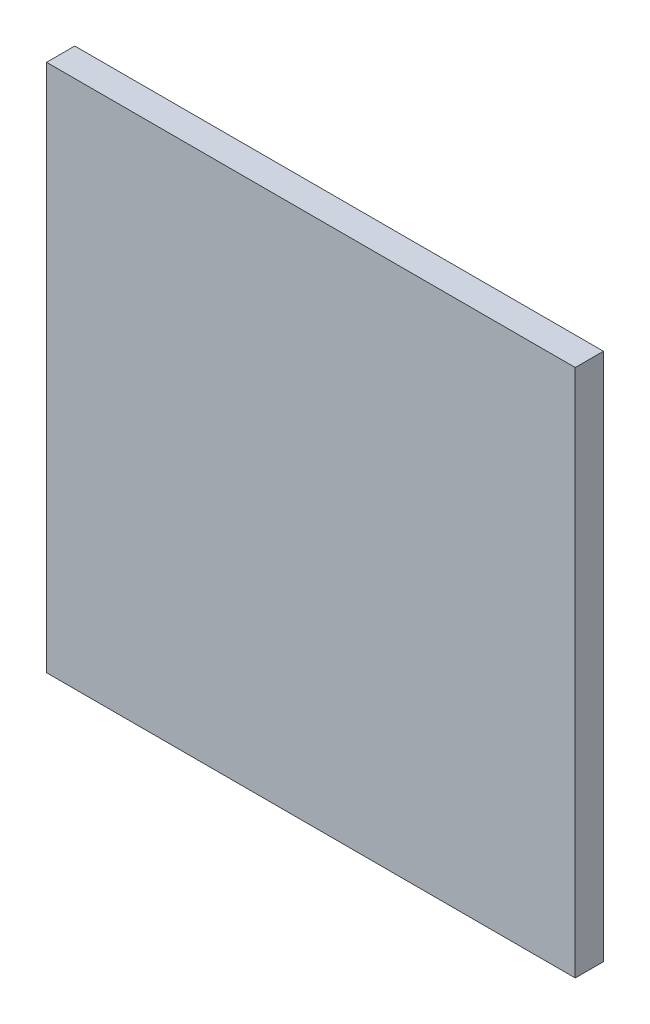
ISO-10303-21;
HEADER;
FILE_DESCRIPTION(('STEP AP214'),'2;1');
FILE_NAME('part.step','',(''),(''),'','','');
FILE_SCHEMA(('AUTOMOTIVE_DESIGN { 1 0 10303 214 1 1 1 1 }'));
ENDSEC;
DATA;
#1=APPLICATION_CONTEXT('core data for automotive mechanical design processes');
#2=APPLICATION_PROTOCOL_DEFINITION('international standard','automotive_design',2000,#1);
#3=PRODUCT_CONTEXT('',#1,'mechanical');
#4=PRODUCT('Part','Part','',(#3));
#5=PRODUCT_RELATED_PRODUCT_CATEGORY('part','',(#4));
#6=PRODUCT_DEFINITION_FORMATION('','',#4);
#7=PRODUCT_DEFINITION_CONTEXT('part definition',#1,'design');
#8=PRODUCT_DEFINITION('design','',#6,#7);
#9=PRODUCT_DEFINITION_SHAPE('','',#8);
#10=(LENGTH_UNIT() NAMED_UNIT(*) SI_UNIT(.MILLI.,.METRE.));
#11=(NAMED_UNIT(*) PLANE_ANGLE_UNIT() SI_UNIT($,.RADIAN.));
#12=(NAMED_UNIT(*) SI_UNIT($,.STERADIAN.) SOLID_ANGLE_UNIT());
#13=UNCERTAINTY_MEASURE_WITH_UNIT(LENGTH_MEASURE(1.E-05),#10,'distance_accuracy_value','');
#14=(GEOMETRIC_REPRESENTATION_CONTEXT(3) GLOBAL_UNCERTAINTY_ASSIGNED_CONTEXT((#13)) GLOBAL_UNIT_ASSIGNED_CONTEXT((#10,
#11,#12)) REPRESENTATION_CONTEXT('',''));
#15=CARTESIAN_POINT('',(0.,0.,0.));
#16=DIRECTION('',(0.,0.,1.));
#17=DIRECTION('',(1.,0.,0.));
#18=AXIS2_PLACEMENT_3D('',#15,#16,#17);
#19=CARTESIAN_POINT('',(-75.,75.,8.));
#20=DIRECTION('',(1.,0.,0.));
#21=DIRECTION('',(0.,1.,0.));
#22=AXIS2_PLACEMENT_3D('',#19,#20,#21);
#23=PLANE('',#22);
#24=DIRECTION('',(0.,-1.,0.));
#25=VECTOR('',#24,1.);
#26=CARTESIAN_POINT('',(-75.,75.,0.));
#27=LINE('',#26,#25);
#28=CARTESIAN_POINT('',(-75.,75.,0.));
#29=VERTEX_POINT('',#28);
#30=CARTESIAN_POINT('',(-75.,-75.,0.));
#31=VERTEX_POINT('',#30);
#32=EDGE_CURVE('E102',#29,#31,#27,.T.);
#33=ORIENTED_EDGE('',*,*,#32,.T.);
#34=DIRECTION('',(0.,0.,-1.));
#35=VECTOR('',#34,1.);
#36=CARTESIAN_POINT('',(-75.,-75.,8.));
#37=LINE('',#36,#35);
#38=CARTESIAN_POINT('',(-75.,-75.,8.));
#39=VERTEX_POINT('',#38);
#40=EDGE_CURVE('E11',#39,#31,#37,.T.);
#41=ORIENTED_EDGE('',*,*,#40,.F.);
#42=DIRECTION('',(0.,-1.,0.));
#43=VECTOR('',#42,1.);
#44=CARTESIAN_POINT('',(-75.,75.,8.));
#45=LINE('',#44,#43);
#46=CARTESIAN_POINT('',(-75.,75.,8.));
#47=VERTEX_POINT('',#46);
#48=EDGE_CURVE('E90',#47,#39,#45,.T.);
#49=ORIENTED_EDGE('',*,*,#48,.F.);
#50=DIRECTION('',(0.,0.,-1.));
#51=VECTOR('',#50,1.);
#52=CARTESIAN_POINT('',(-75.,75.,8.));
#53=LINE('',#52,#51);
#54=EDGE_CURVE('E98',#47,#29,#53,.T.);
#55=ORIENTED_EDGE('',*,*,#54,.T.);
#56=EDGE_LOOP('',(#33,#41,#49,#55));
#57=FACE_BOUND('',#56,.T.);
#58=ADVANCED_FACE('F39',(#57),#23,.F.);
#59=CARTESIAN_POINT('',(-75.,-75.,8.));
#60=DIRECTION('',(0.,1.,0.));
#61=DIRECTION('',(-1.,0.,0.));
#62=AXIS2_PLACEMENT_3D('',#59,#60,#61);
#63=PLANE('',#62);
#64=DIRECTION('',(1.,0.,0.));
#65=VECTOR('',#64,1.);
#66=CARTESIAN_POINT('',(-75.,-75.,0.));
#67=LINE('',#66,#65);
#68=CARTESIAN_POINT('',(75.,-75.,0.));
#69=VERTEX_POINT('',#68);
#70=EDGE_CURVE('E94',#31,#69,#67,.T.);
#71=ORIENTED_EDGE('',*,*,#70,.T.);
#72=DIRECTION('',(0.,0.,-1.));
#73=VECTOR('',#72,1.);
#74=CARTESIAN_POINT('',(75.,-75.,8.));
#75=LINE('',#74,#73);
#76=CARTESIAN_POINT('',(75.,-75.,8.));
#77=VERTEX_POINT('',#76);
#78=EDGE_CURVE('E47',#77,#69,#75,.T.);
#79=ORIENTED_EDGE('',*,*,#78,.F.);
#80=DIRECTION('',(1.,0.,0.));
#81=VECTOR('',#80,1.);
#82=CARTESIAN_POINT('',(-75.,-75.,8.));
#83=LINE('',#82,#81);
#84=EDGE_CURVE('E85',#39,#77,#83,.T.);
#85=ORIENTED_EDGE('',*,*,#84,.F.);
#86=ORIENTED_EDGE('',*,*,#40,.T.);
#87=EDGE_LOOP('',(#71,#79,#85,#86));
#88=FACE_BOUND('',#87,.T.);
#89=ADVANCED_FACE('F93',(#88),#63,.F.);
#90=CARTESIAN_POINT('',(75.,75.,8.));
#91=DIRECTION('',(-1.,0.,0.));
#92=DIRECTION('',(0.,0.,1.));
#93=AXIS2_PLACEMENT_3D('',#90,#91,#92);
#94=PLANE('',#93);
#95=DIRECTION('',(0.,1.,0.));
#96=VECTOR('',#95,1.);
#97=CARTESIAN_POINT('',(75.,75.,0.));
#98=LINE('',#97,#96);
#99=CARTESIAN_POINT('',(75.,75.,0.));
#100=VERTEX_POINT('',#99);
#101=EDGE_CURVE('E72',#69,#100,#98,.T.);
#102=ORIENTED_EDGE('',*,*,#101,.T.);
#103=DIRECTION('',(0.,0.,-1.));
#104=VECTOR('',#103,1.);
#105=CARTESIAN_POINT('',(75.,75.,8.));
#106=LINE('',#105,#104);
#107=CARTESIAN_POINT('',(75.,75.,8.));
#108=VERTEX_POINT('',#107);
#109=EDGE_CURVE('E95',#108,#100,#106,.T.);
#110=ORIENTED_EDGE('',*,*,#109,.F.);
#111=DIRECTION('',(0.,1.,0.));
#112=VECTOR('',#111,1.);
#113=CARTESIAN_POINT('',(75.,75.,8.));
#114=LINE('',#113,#112);
#115=EDGE_CURVE('E88',#77,#108,#114,.T.);
#116=ORIENTED_EDGE('',*,*,#115,.F.);
#117=ORIENTED_EDGE('',*,*,#78,.T.);
#118=EDGE_LOOP('',(#102,#110,#116,#117));
#119=FACE_BOUND('',#118,.T.);
#120=ADVANCED_FACE('F96',(#119),#94,.F.);
#121=CARTESIAN_POINT('',(-75.,75.,8.));
#122=DIRECTION('',(0.,-1.,0.));
#123=DIRECTION('',(0.,0.,-1.));
#124=AXIS2_PLACEMENT_3D('',#121,#122,#123);
#125=PLANE('',#124);
#126=DIRECTION('',(-1.,0.,0.));
#127=VECTOR('',#126,1.);
#128=CARTESIAN_POINT('',(-75.,75.,0.));
#129=LINE('',#128,#127);
#130=EDGE_CURVE('E78',#100,#29,#129,.T.);
#131=ORIENTED_EDGE('',*,*,#130,.T.);
#132=ORIENTED_EDGE('',*,*,#54,.F.);
#133=DIRECTION('',(-1.,0.,0.));
#134=VECTOR('',#133,1.);
#135=CARTESIAN_POINT('',(-75.,75.,8.));
#136=LINE('',#135,#134);
#137=EDGE_CURVE('E55',#108,#47,#136,.T.);
#138=ORIENTED_EDGE('',*,*,#137,.F.);
#139=ORIENTED_EDGE('',*,*,#109,.T.);
#140=EDGE_LOOP('',(#131,#132,#138,#139));
#141=FACE_BOUND('',#140,.T.);
#142=ADVANCED_FACE('F109',(#141),#125,.F.);
#143=CARTESIAN_POINT('',(-75.,-75.,8.));
#144=DIRECTION('',(0.,0.,1.));
#145=DIRECTION('',(1.,0.,0.));
#146=AXIS2_PLACEMENT_3D('',#143,#144,#145);
#147=PLANE('',#146);
#148=ORIENTED_EDGE('',*,*,#48,.T.);
#149=ORIENTED_EDGE('',*,*,#84,.T.);
#150=ORIENTED_EDGE('',*,*,#115,.T.);
#151=ORIENTED_EDGE('',*,*,#137,.T.);
#152=EDGE_LOOP('',(#148,#149,#150,#151));
#153=FACE_BOUND('',#152,.T.);
#154=ADVANCED_FACE('F86',(#153),#147,.T.);
#155=CARTESIAN_POINT('',(-75.,-75.,0.));
#156=DIRECTION('',(0.,0.,1.));
#157=DIRECTION('',(1.,0.,0.));
#158=AXIS2_PLACEMENT_3D('',#155,#156,#157);
#159=PLANE('',#158);
#160=ORIENTED_EDGE('',*,*,#32,.F.);
#161=ORIENTED_EDGE('',*,*,#130,.F.);
#162=ORIENTED_EDGE('',*,*,#101,.F.);
#163=ORIENTED_EDGE('',*,*,#70,.F.);
#164=EDGE_LOOP('',(#160,#161,#162,#163));
#165=FACE_BOUND('',#164,.T.);
#166=ADVANCED_FACE('F112',(#165),#159,.F.);
#167=CLOSED_SHELL('',(#58,#89,#120,#142,#154,#166));
#168=MANIFOLD_SOLID_BREP('B2',#167);
#169=ADVANCED_BREP_SHAPE_REPRESENTATION('',(#18,#168),#14);
#170=SHAPE_DEFINITION_REPRESENTATION(#9,#169);
ENDSEC;
END-ISO-10303-21;
